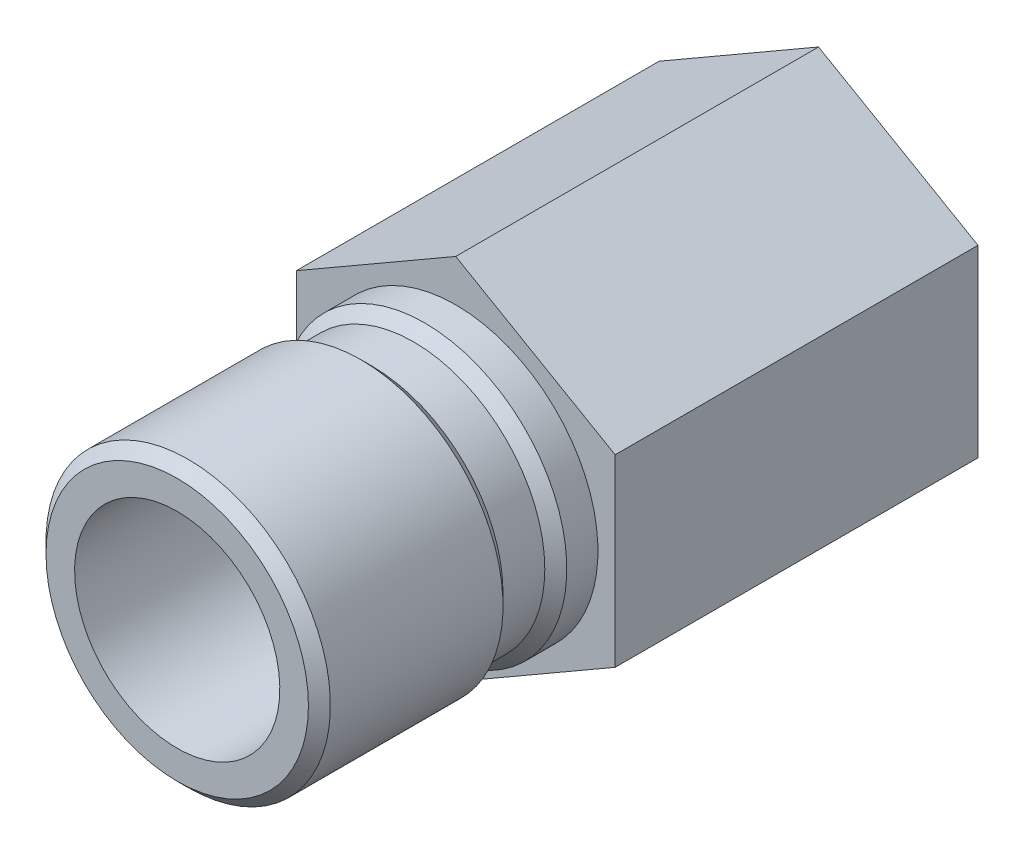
ISO-10303-21;
HEADER;
FILE_DESCRIPTION(('STEP AP214'),'2;1');
FILE_NAME('part.step','',(''),(''),'','','');
FILE_SCHEMA(('AUTOMOTIVE_DESIGN { 1 0 10303 214 1 1 1 1 }'));
ENDSEC;
DATA;
#1=APPLICATION_CONTEXT('core data for automotive mechanical design processes');
#2=APPLICATION_PROTOCOL_DEFINITION('international standard','automotive_design',2000,#1);
#3=PRODUCT_CONTEXT('',#1,'mechanical');
#4=PRODUCT('Part','Part','',(#3));
#5=PRODUCT_RELATED_PRODUCT_CATEGORY('part','',(#4));
#6=PRODUCT_DEFINITION_FORMATION('','',#4);
#7=PRODUCT_DEFINITION_CONTEXT('part definition',#1,'design');
#8=PRODUCT_DEFINITION('design','',#6,#7);
#9=PRODUCT_DEFINITION_SHAPE('','',#8);
#10=(LENGTH_UNIT() NAMED_UNIT(*) SI_UNIT(.MILLI.,.METRE.));
#11=(NAMED_UNIT(*) PLANE_ANGLE_UNIT() SI_UNIT($,.RADIAN.));
#12=(NAMED_UNIT(*) SI_UNIT($,.STERADIAN.) SOLID_ANGLE_UNIT());
#13=UNCERTAINTY_MEASURE_WITH_UNIT(LENGTH_MEASURE(1.E-05),#10,'distance_accuracy_value','');
#14=(GEOMETRIC_REPRESENTATION_CONTEXT(3) GLOBAL_UNCERTAINTY_ASSIGNED_CONTEXT((#13)) GLOBAL_UNIT_ASSIGNED_CONTEXT((#10,
#11,#12)) REPRESENTATION_CONTEXT('',''));
#15=CARTESIAN_POINT('',(0.,0.,0.));
#16=DIRECTION('',(0.,0.,1.));
#17=DIRECTION('',(1.,0.,0.));
#18=AXIS2_PLACEMENT_3D('',#15,#16,#17);
#19=CARTESIAN_POINT('',(0.,9.8552,0.));
#20=DIRECTION('',(0.,0.,1.));
#21=DIRECTION('',(0.,-1.,0.));
#22=AXIS2_PLACEMENT_3D('',#19,#20,#21);
#23=PLANE('',#22);
#24=CARTESIAN_POINT('',(0.,0.,0.));
#25=DIRECTION('',(0.,0.,-1.));
#26=DIRECTION('',(0.,1.,0.));
#27=AXIS2_PLACEMENT_3D('',#24,#25,#26);
#28=CIRCLE('',#27,9.8552);
#29=CARTESIAN_POINT('',(0.,9.8552,0.));
#30=VERTEX_POINT('',#29);
#31=EDGE_CURVE('E147',#30,#30,#28,.T.);
#32=ORIENTED_EDGE('',*,*,#31,.T.);
#33=EDGE_LOOP('',(#32));
#34=FACE_BOUND('',#33,.T.);
#35=DIRECTION('',(-0.866025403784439,0.5,0.));
#36=VECTOR('',#35,1.);
#37=CARTESIAN_POINT('',(11.049,6.37914312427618,0.));
#38=LINE('',#37,#36);
#39=CARTESIAN_POINT('',(11.049,6.37914312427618,0.));
#40=VERTEX_POINT('',#39);
#41=CARTESIAN_POINT('',(0.,12.7582862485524,0.));
#42=VERTEX_POINT('',#41);
#43=EDGE_CURVE('E128',#40,#42,#38,.T.);
#44=ORIENTED_EDGE('',*,*,#43,.T.);
#45=DIRECTION('',(-0.866025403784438,-0.5,0.));
#46=VECTOR('',#45,1.);
#47=CARTESIAN_POINT('',(0.,12.7582862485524,0.));
#48=LINE('',#47,#46);
#49=CARTESIAN_POINT('',(-11.049,6.37914312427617,0.));
#50=VERTEX_POINT('',#49);
#51=EDGE_CURVE('E117',#42,#50,#48,.T.);
#52=ORIENTED_EDGE('',*,*,#51,.T.);
#53=DIRECTION('',(0.,-1.,0.));
#54=VECTOR('',#53,1.);
#55=CARTESIAN_POINT('',(-11.049,6.37914312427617,0.));
#56=LINE('',#55,#54);
#57=CARTESIAN_POINT('',(-11.049,-6.37914312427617,0.));
#58=VERTEX_POINT('',#57);
#59=EDGE_CURVE('E120',#50,#58,#56,.T.);
#60=ORIENTED_EDGE('',*,*,#59,.T.);
#61=DIRECTION('',(0.866025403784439,-0.5,0.));
#62=VECTOR('',#61,1.);
#63=CARTESIAN_POINT('',(-11.049,-6.37914312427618,0.));
#64=LINE('',#63,#62);
#65=CARTESIAN_POINT('',(0.,-12.7582862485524,0.));
#66=VERTEX_POINT('',#65);
#67=EDGE_CURVE('E48',#58,#66,#64,.T.);
#68=ORIENTED_EDGE('',*,*,#67,.T.);
#69=DIRECTION('',(0.866025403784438,0.5,0.));
#70=VECTOR('',#69,1.);
#71=CARTESIAN_POINT('',(0.,-12.7582862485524,0.));
#72=LINE('',#71,#70);
#73=CARTESIAN_POINT('',(11.049,-6.37914312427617,0.));
#74=VERTEX_POINT('',#73);
#75=EDGE_CURVE('E93',#66,#74,#72,.T.);
#76=ORIENTED_EDGE('',*,*,#75,.T.);
#77=DIRECTION('',(0.,1.,0.));
#78=VECTOR('',#77,1.);
#79=CARTESIAN_POINT('',(11.049,-6.37914312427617,0.));
#80=LINE('',#79,#78);
#81=EDGE_CURVE('E125',#74,#40,#80,.T.);
#82=ORIENTED_EDGE('',*,*,#81,.T.);
#83=EDGE_LOOP('',(#44,#52,#60,#68,#76,#82));
#84=FACE_BOUND('',#83,.T.);
#85=ADVANCED_FACE('F33',(#34,#84),#23,.T.);
#86=CARTESIAN_POINT('',(0.,12.75842,-25.146));
#87=DIRECTION('',(0.,0.,-1.));
#88=DIRECTION('',(0.,1.,0.));
#89=AXIS2_PLACEMENT_3D('',#86,#87,#88);
#90=PLANE('',#89);
#91=CARTESIAN_POINT('',(0.,0.,-25.146));
#92=DIRECTION('',(0.,0.,-1.));
#93=DIRECTION('',(0.,1.,0.));
#94=AXIS2_PLACEMENT_3D('',#91,#92,#93);
#95=CIRCLE('',#94,9.40561717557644);
#96=CARTESIAN_POINT('',(0.,9.40561717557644,-25.146));
#97=VERTEX_POINT('',#96);
#98=EDGE_CURVE('E144',#97,#97,#95,.T.);
#99=ORIENTED_EDGE('',*,*,#98,.F.);
#100=EDGE_LOOP('',(#99));
#101=FACE_BOUND('',#100,.T.);
#102=DIRECTION('',(0.,-1.,0.));
#103=VECTOR('',#102,1.);
#104=CARTESIAN_POINT('',(-11.049,6.37914312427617,-25.146));
#105=LINE('',#104,#103);
#106=CARTESIAN_POINT('',(-11.049,6.37914312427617,-25.146));
#107=VERTEX_POINT('',#106);
#108=CARTESIAN_POINT('',(-11.049,-6.37914312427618,-25.146));
#109=VERTEX_POINT('',#108);
#110=EDGE_CURVE('E103',#107,#109,#105,.T.);
#111=ORIENTED_EDGE('',*,*,#110,.F.);
#112=DIRECTION('',(-0.866025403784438,-0.5,0.));
#113=VECTOR('',#112,1.);
#114=CARTESIAN_POINT('',(0.,12.7582862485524,-25.146));
#115=LINE('',#114,#113);
#116=CARTESIAN_POINT('',(0.,12.7582862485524,-25.146));
#117=VERTEX_POINT('',#116);
#118=EDGE_CURVE('E56',#117,#107,#115,.T.);
#119=ORIENTED_EDGE('',*,*,#118,.F.);
#120=DIRECTION('',(-0.866025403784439,0.5,0.));
#121=VECTOR('',#120,1.);
#122=CARTESIAN_POINT('',(11.049,6.37914312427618,-25.146));
#123=LINE('',#122,#121);
#124=CARTESIAN_POINT('',(11.049,6.37914312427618,-25.146));
#125=VERTEX_POINT('',#124);
#126=EDGE_CURVE('E110',#125,#117,#123,.T.);
#127=ORIENTED_EDGE('',*,*,#126,.F.);
#128=DIRECTION('',(0.,1.,0.));
#129=VECTOR('',#128,1.);
#130=CARTESIAN_POINT('',(11.049,-6.37914312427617,-25.146));
#131=LINE('',#130,#129);
#132=CARTESIAN_POINT('',(11.049,-6.37914312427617,-25.146));
#133=VERTEX_POINT('',#132);
#134=EDGE_CURVE('E108',#133,#125,#131,.T.);
#135=ORIENTED_EDGE('',*,*,#134,.F.);
#136=DIRECTION('',(0.866025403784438,0.5,0.));
#137=VECTOR('',#136,1.);
#138=CARTESIAN_POINT('',(0.,-12.7582862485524,-25.146));
#139=LINE('',#138,#137);
#140=CARTESIAN_POINT('',(0.,-12.7582862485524,-25.146));
#141=VERTEX_POINT('',#140);
#142=EDGE_CURVE('E90',#141,#133,#139,.T.);
#143=ORIENTED_EDGE('',*,*,#142,.F.);
#144=DIRECTION('',(0.866025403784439,-0.5,0.));
#145=VECTOR('',#144,1.);
#146=CARTESIAN_POINT('',(-11.049,-6.37914312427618,-25.146));
#147=LINE('',#146,#145);
#148=EDGE_CURVE('E98',#109,#141,#147,.T.);
#149=ORIENTED_EDGE('',*,*,#148,.F.);
#150=EDGE_LOOP('',(#111,#119,#127,#135,#143,#149));
#151=FACE_BOUND('',#150,.T.);
#152=ADVANCED_FACE('F105',(#101,#151),#90,.T.);
#153=CARTESIAN_POINT('',(0.,0.,0.));
#154=DIRECTION('',(0.,0.,-1.));
#155=DIRECTION('',(0.,1.,0.));
#156=AXIS2_PLACEMENT_3D('',#153,#154,#155);
#157=CYLINDRICAL_SURFACE('',#156,7.112);
#158=CARTESIAN_POINT('',(0.,0.,-8.93968723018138));
#159=DIRECTION('',(0.,0.,-1.));
#160=DIRECTION('',(0.,1.,0.));
#161=AXIS2_PLACEMENT_3D('',#158,#159,#160);
#162=CIRCLE('',#161,7.112);
#163=CARTESIAN_POINT('',(0.,7.112,-8.93968723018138));
#164=VERTEX_POINT('',#163);
#165=EDGE_CURVE('E133',#164,#164,#162,.T.);
#166=ORIENTED_EDGE('',*,*,#165,.T.);
#167=EDGE_LOOP('',(#166));
#168=FACE_BOUND('',#167,.T.);
#169=CARTESIAN_POINT('',(0.,0.,19.304));
#170=DIRECTION('',(0.,0.,-1.));
#171=DIRECTION('',(0.,1.,0.));
#172=AXIS2_PLACEMENT_3D('',#169,#170,#171);
#173=CIRCLE('',#172,7.112);
#174=CARTESIAN_POINT('',(0.,7.112,19.304));
#175=VERTEX_POINT('',#174);
#176=EDGE_CURVE('E12',#175,#175,#173,.T.);
#177=ORIENTED_EDGE('',*,*,#176,.F.);
#178=EDGE_LOOP('',(#177));
#179=FACE_BOUND('',#178,.T.);
#180=ADVANCED_FACE('F35',(#168,#179),#157,.F.);
#181=CARTESIAN_POINT('',(0.,7.112,19.304));
#182=DIRECTION('',(0.,0.,1.));
#183=DIRECTION('',(0.,-1.,0.));
#184=AXIS2_PLACEMENT_3D('',#181,#182,#183);
#185=PLANE('',#184);
#186=ORIENTED_EDGE('',*,*,#176,.T.);
#187=EDGE_LOOP('',(#186));
#188=FACE_BOUND('',#187,.T.);
#189=CARTESIAN_POINT('',(0.,0.,19.304));
#190=DIRECTION('',(0.,0.,-1.));
#191=DIRECTION('',(0.,1.,0.));
#192=AXIS2_PLACEMENT_3D('',#189,#190,#191);
#193=CIRCLE('',#192,9.0932);
#194=CARTESIAN_POINT('',(0.,9.0932,19.304));
#195=VERTEX_POINT('',#194);
#196=EDGE_CURVE('E41',#195,#195,#193,.T.);
#197=ORIENTED_EDGE('',*,*,#196,.F.);
#198=EDGE_LOOP('',(#197));
#199=FACE_BOUND('',#198,.T.);
#200=ADVANCED_FACE('F170',(#188,#199),#185,.T.);
#201=CARTESIAN_POINT('',(0.,0.,18.542));
#202=DIRECTION('',(0.,0.,-1.));
#203=DIRECTION('',(0.,1.,0.));
#204=AXIS2_PLACEMENT_3D('',#201,#202,#203);
#205=CONICAL_SURFACE('',#204,9.8552,0.785398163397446);
#206=ORIENTED_EDGE('',*,*,#196,.T.);
#207=EDGE_LOOP('',(#206));
#208=FACE_BOUND('',#207,.T.);
#209=CARTESIAN_POINT('',(0.,0.,18.542));
#210=DIRECTION('',(0.,0.,-1.));
#211=DIRECTION('',(0.,1.,0.));
#212=AXIS2_PLACEMENT_3D('',#209,#210,#211);
#213=CIRCLE('',#212,9.8552);
#214=CARTESIAN_POINT('',(0.,9.8552,18.542));
#215=VERTEX_POINT('',#214);
#216=EDGE_CURVE('E162',#215,#215,#213,.T.);
#217=ORIENTED_EDGE('',*,*,#216,.F.);
#218=EDGE_LOOP('',(#217));
#219=FACE_BOUND('',#218,.T.);
#220=ADVANCED_FACE('F167',(#208,#219),#205,.T.);
#221=CARTESIAN_POINT('',(0.,0.,0.));
#222=DIRECTION('',(0.,0.,-1.));
#223=DIRECTION('',(0.,1.,0.));
#224=AXIS2_PLACEMENT_3D('',#221,#222,#223);
#225=CYLINDRICAL_SURFACE('',#224,9.8552);
#226=ORIENTED_EDGE('',*,*,#216,.T.);
#227=EDGE_LOOP('',(#226));
#228=FACE_BOUND('',#227,.T.);
#229=CARTESIAN_POINT('',(0.,0.,6.5786));
#230=DIRECTION('',(0.,0.,-1.));
#231=DIRECTION('',(0.,1.,0.));
#232=AXIS2_PLACEMENT_3D('',#229,#230,#231);
#233=CIRCLE('',#232,9.8552);
#234=CARTESIAN_POINT('',(0.,9.8552,6.5786));
#235=VERTEX_POINT('',#234);
#236=EDGE_CURVE('E159',#235,#235,#233,.T.);
#237=ORIENTED_EDGE('',*,*,#236,.F.);
#238=EDGE_LOOP('',(#237));
#239=FACE_BOUND('',#238,.T.);
#240=ADVANCED_FACE('F177',(#228,#239),#225,.T.);
#241=CARTESIAN_POINT('',(0.,0.,5.8166));
#242=DIRECTION('',(0.,0.,1.));
#243=DIRECTION('',(0.,-1.,0.));
#244=AXIS2_PLACEMENT_3D('',#241,#242,#243);
#245=CONICAL_SURFACE('',#244,9.0932,0.785398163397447);
#246=ORIENTED_EDGE('',*,*,#236,.T.);
#247=EDGE_LOOP('',(#246));
#248=FACE_BOUND('',#247,.T.);
#249=CARTESIAN_POINT('',(0.,0.,5.8166));
#250=DIRECTION('',(0.,0.,-1.));
#251=DIRECTION('',(0.,1.,0.));
#252=AXIS2_PLACEMENT_3D('',#249,#250,#251);
#253=CIRCLE('',#252,9.0932);
#254=CARTESIAN_POINT('',(0.,9.0932,5.8166));
#255=VERTEX_POINT('',#254);
#256=EDGE_CURVE('E156',#255,#255,#253,.T.);
#257=ORIENTED_EDGE('',*,*,#256,.F.);
#258=EDGE_LOOP('',(#257));
#259=FACE_BOUND('',#258,.T.);
#260=ADVANCED_FACE('F203',(#248,#259),#245,.T.);
#261=CARTESIAN_POINT('',(0.,0.,0.));
#262=DIRECTION('',(0.,0.,-1.));
#263=DIRECTION('',(0.,1.,0.));
#264=AXIS2_PLACEMENT_3D('',#261,#262,#263);
#265=CYLINDRICAL_SURFACE('',#264,9.0932);
#266=ORIENTED_EDGE('',*,*,#256,.T.);
#267=EDGE_LOOP('',(#266));
#268=FACE_BOUND('',#267,.T.);
#269=CARTESIAN_POINT('',(0.,0.,2.921));
#270=DIRECTION('',(0.,0.,-1.));
#271=DIRECTION('',(0.,1.,0.));
#272=AXIS2_PLACEMENT_3D('',#269,#270,#271);
#273=CIRCLE('',#272,9.0932);
#274=CARTESIAN_POINT('',(0.,9.0932,2.921));
#275=VERTEX_POINT('',#274);
#276=EDGE_CURVE('E153',#275,#275,#273,.T.);
#277=ORIENTED_EDGE('',*,*,#276,.F.);
#278=EDGE_LOOP('',(#277));
#279=FACE_BOUND('',#278,.T.);
#280=ADVANCED_FACE('F199',(#268,#279),#265,.T.);
#281=CARTESIAN_POINT('',(0.,0.,2.159));
#282=DIRECTION('',(0.,0.,-1.));
#283=DIRECTION('',(0.,1.,0.));
#284=AXIS2_PLACEMENT_3D('',#281,#282,#283);
#285=CONICAL_SURFACE('',#284,9.8552,0.785398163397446);
#286=ORIENTED_EDGE('',*,*,#276,.T.);
#287=EDGE_LOOP('',(#286));
#288=FACE_BOUND('',#287,.T.);
#289=CARTESIAN_POINT('',(0.,0.,2.159));
#290=DIRECTION('',(0.,0.,-1.));
#291=DIRECTION('',(0.,1.,0.));
#292=AXIS2_PLACEMENT_3D('',#289,#290,#291);
#293=CIRCLE('',#292,9.8552);
#294=CARTESIAN_POINT('',(0.,9.8552,2.159));
#295=VERTEX_POINT('',#294);
#296=EDGE_CURVE('E150',#295,#295,#293,.T.);
#297=ORIENTED_EDGE('',*,*,#296,.F.);
#298=EDGE_LOOP('',(#297));
#299=FACE_BOUND('',#298,.T.);
#300=ADVANCED_FACE('F195',(#288,#299),#285,.T.);
#301=CARTESIAN_POINT('',(0.,0.,0.));
#302=DIRECTION('',(0.,0.,-1.));
#303=DIRECTION('',(0.,1.,0.));
#304=AXIS2_PLACEMENT_3D('',#301,#302,#303);
#305=CYLINDRICAL_SURFACE('',#304,9.8552);
#306=ORIENTED_EDGE('',*,*,#296,.T.);
#307=EDGE_LOOP('',(#306));
#308=FACE_BOUND('',#307,.T.);
#309=ORIENTED_EDGE('',*,*,#31,.F.);
#310=EDGE_LOOP('',(#309));
#311=FACE_BOUND('',#310,.T.);
#312=ADVANCED_FACE('F191',(#308,#311),#305,.T.);
#313=CARTESIAN_POINT('',(0.,0.,-9.906));
#314=DIRECTION('',(0.,0.,-1.));
#315=DIRECTION('',(0.,1.,0.));
#316=AXIS2_PLACEMENT_3D('',#313,#314,#315);
#317=CONICAL_SURFACE('',#316,8.92937,0.0312396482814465);
#318=ORIENTED_EDGE('',*,*,#98,.T.);
#319=EDGE_LOOP('',(#318));
#320=FACE_BOUND('',#319,.T.);
#321=CARTESIAN_POINT('',(0.,0.,-9.906));
#322=DIRECTION('',(0.,0.,-1.));
#323=DIRECTION('',(0.,1.,0.));
#324=AXIS2_PLACEMENT_3D('',#321,#322,#323);
#325=CIRCLE('',#324,8.92937);
#326=CARTESIAN_POINT('',(0.,8.92937,-9.906));
#327=VERTEX_POINT('',#326);
#328=EDGE_CURVE('E141',#327,#327,#325,.T.);
#329=ORIENTED_EDGE('',*,*,#328,.F.);
#330=EDGE_LOOP('',(#329));
#331=FACE_BOUND('',#330,.T.);
#332=ADVANCED_FACE('F194',(#320,#331),#317,.F.);
#333=CARTESIAN_POINT('',(0.,0.,-8.93968723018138));
#334=DIRECTION('',(0.,0.,-1.));
#335=DIRECTION('',(0.,1.,0.));
#336=AXIS2_PLACEMENT_3D('',#333,#334,#335);
#337=CONICAL_SURFACE('',#336,7.112,1.08210413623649);
#338=ORIENTED_EDGE('',*,*,#328,.T.);
#339=EDGE_LOOP('',(#338));
#340=FACE_BOUND('',#339,.T.);
#341=ORIENTED_EDGE('',*,*,#165,.F.);
#342=EDGE_LOOP('',(#341));
#343=FACE_BOUND('',#342,.T.);
#344=ADVANCED_FACE('F247',(#340,#343),#337,.F.);
#345=CARTESIAN_POINT('',(0.,12.7582862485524,-25.146));
#346=DIRECTION('',(-0.5,0.866025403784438,0.));
#347=DIRECTION('',(-0.866025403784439,-0.5,0.));
#348=AXIS2_PLACEMENT_3D('',#345,#346,#347);
#349=PLANE('',#348);
#350=ORIENTED_EDGE('',*,*,#51,.F.);
#351=DIRECTION('',(0.,0.,1.));
#352=VECTOR('',#351,1.);
#353=CARTESIAN_POINT('',(0.,12.7582862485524,-25.146));
#354=LINE('',#353,#352);
#355=EDGE_CURVE('E131',#117,#42,#354,.T.);
#356=ORIENTED_EDGE('',*,*,#355,.F.);
#357=ORIENTED_EDGE('',*,*,#118,.T.);
#358=DIRECTION('',(0.,0.,1.));
#359=VECTOR('',#358,1.);
#360=CARTESIAN_POINT('',(-11.049,6.37914312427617,-25.146));
#361=LINE('',#360,#359);
#362=EDGE_CURVE('E116',#107,#50,#361,.T.);
#363=ORIENTED_EDGE('',*,*,#362,.T.);
#364=EDGE_LOOP('',(#350,#356,#357,#363));
#365=FACE_BOUND('',#364,.T.);
#366=ADVANCED_FACE('F254',(#365),#349,.T.);
#367=CARTESIAN_POINT('',(11.049,6.37914312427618,-25.146));
#368=DIRECTION('',(0.5,0.866025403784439,0.));
#369=DIRECTION('',(-0.866025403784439,0.5,0.));
#370=AXIS2_PLACEMENT_3D('',#367,#368,#369);
#371=PLANE('',#370);
#372=ORIENTED_EDGE('',*,*,#43,.F.);
#373=DIRECTION('',(0.,0.,1.));
#374=VECTOR('',#373,1.);
#375=CARTESIAN_POINT('',(11.049,6.37914312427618,-25.146));
#376=LINE('',#375,#374);
#377=EDGE_CURVE('E134',#125,#40,#376,.T.);
#378=ORIENTED_EDGE('',*,*,#377,.F.);
#379=ORIENTED_EDGE('',*,*,#126,.T.);
#380=ORIENTED_EDGE('',*,*,#355,.T.);
#381=EDGE_LOOP('',(#372,#378,#379,#380));
#382=FACE_BOUND('',#381,.T.);
#383=ADVANCED_FACE('F262',(#382),#371,.T.);
#384=CARTESIAN_POINT('',(11.049,-6.37914312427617,-25.146));
#385=DIRECTION('',(1.,0.,0.));
#386=DIRECTION('',(0.,1.,0.));
#387=AXIS2_PLACEMENT_3D('',#384,#385,#386);
#388=PLANE('',#387);
#389=ORIENTED_EDGE('',*,*,#81,.F.);
#390=DIRECTION('',(0.,0.,1.));
#391=VECTOR('',#390,1.);
#392=CARTESIAN_POINT('',(11.049,-6.37914312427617,-25.146));
#393=LINE('',#392,#391);
#394=EDGE_CURVE('E94',#133,#74,#393,.T.);
#395=ORIENTED_EDGE('',*,*,#394,.F.);
#396=ORIENTED_EDGE('',*,*,#134,.T.);
#397=ORIENTED_EDGE('',*,*,#377,.T.);
#398=EDGE_LOOP('',(#389,#395,#396,#397));
#399=FACE_BOUND('',#398,.T.);
#400=ADVANCED_FACE('F270',(#399),#388,.T.);
#401=CARTESIAN_POINT('',(0.,-12.7582862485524,-25.146));
#402=DIRECTION('',(0.5,-0.866025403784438,0.));
#403=DIRECTION('',(0.866025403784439,0.5,0.));
#404=AXIS2_PLACEMENT_3D('',#401,#402,#403);
#405=PLANE('',#404);
#406=ORIENTED_EDGE('',*,*,#75,.F.);
#407=DIRECTION('',(0.,0.,1.));
#408=VECTOR('',#407,1.);
#409=CARTESIAN_POINT('',(0.,-12.7582862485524,-25.146));
#410=LINE('',#409,#408);
#411=EDGE_CURVE('E86',#141,#66,#410,.T.);
#412=ORIENTED_EDGE('',*,*,#411,.F.);
#413=ORIENTED_EDGE('',*,*,#142,.T.);
#414=ORIENTED_EDGE('',*,*,#394,.T.);
#415=EDGE_LOOP('',(#406,#412,#413,#414));
#416=FACE_BOUND('',#415,.T.);
#417=ADVANCED_FACE('F88',(#416),#405,.T.);
#418=CARTESIAN_POINT('',(-11.049,-6.37914312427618,-25.146));
#419=DIRECTION('',(-0.5,-0.866025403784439,0.));
#420=DIRECTION('',(0.866025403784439,-0.5,0.));
#421=AXIS2_PLACEMENT_3D('',#418,#419,#420);
#422=PLANE('',#421);
#423=ORIENTED_EDGE('',*,*,#67,.F.);
#424=DIRECTION('',(0.,0.,1.));
#425=VECTOR('',#424,1.);
#426=CARTESIAN_POINT('',(-11.049,-6.37914312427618,-25.146));
#427=LINE('',#426,#425);
#428=EDGE_CURVE('E95',#109,#58,#427,.T.);
#429=ORIENTED_EDGE('',*,*,#428,.F.);
#430=ORIENTED_EDGE('',*,*,#148,.T.);
#431=ORIENTED_EDGE('',*,*,#411,.T.);
#432=EDGE_LOOP('',(#423,#429,#430,#431));
#433=FACE_BOUND('',#432,.T.);
#434=ADVANCED_FACE('F99',(#433),#422,.T.);
#435=CARTESIAN_POINT('',(-11.049,6.37914312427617,-25.146));
#436=DIRECTION('',(-1.,0.,0.));
#437=DIRECTION('',(0.,0.,1.));
#438=AXIS2_PLACEMENT_3D('',#435,#436,#437);
#439=PLANE('',#438);
#440=ORIENTED_EDGE('',*,*,#59,.F.);
#441=ORIENTED_EDGE('',*,*,#362,.F.);
#442=ORIENTED_EDGE('',*,*,#110,.T.);
#443=ORIENTED_EDGE('',*,*,#428,.T.);
#444=EDGE_LOOP('',(#440,#441,#442,#443));
#445=FACE_BOUND('',#444,.T.);
#446=ADVANCED_FACE('F291',(#445),#439,.T.);
#447=CLOSED_SHELL('',(#85,#152,#180,#200,#220,#240,#260,#280,#300,#312,#332,#344,#366,#383,#400,
#417,#434,#446));
#448=MANIFOLD_SOLID_BREP('B2',#447);
#449=ADVANCED_BREP_SHAPE_REPRESENTATION('',(#18,#448),#14);
#450=SHAPE_DEFINITION_REPRESENTATION(#9,#449);
ENDSEC;
END-ISO-10303-21;
